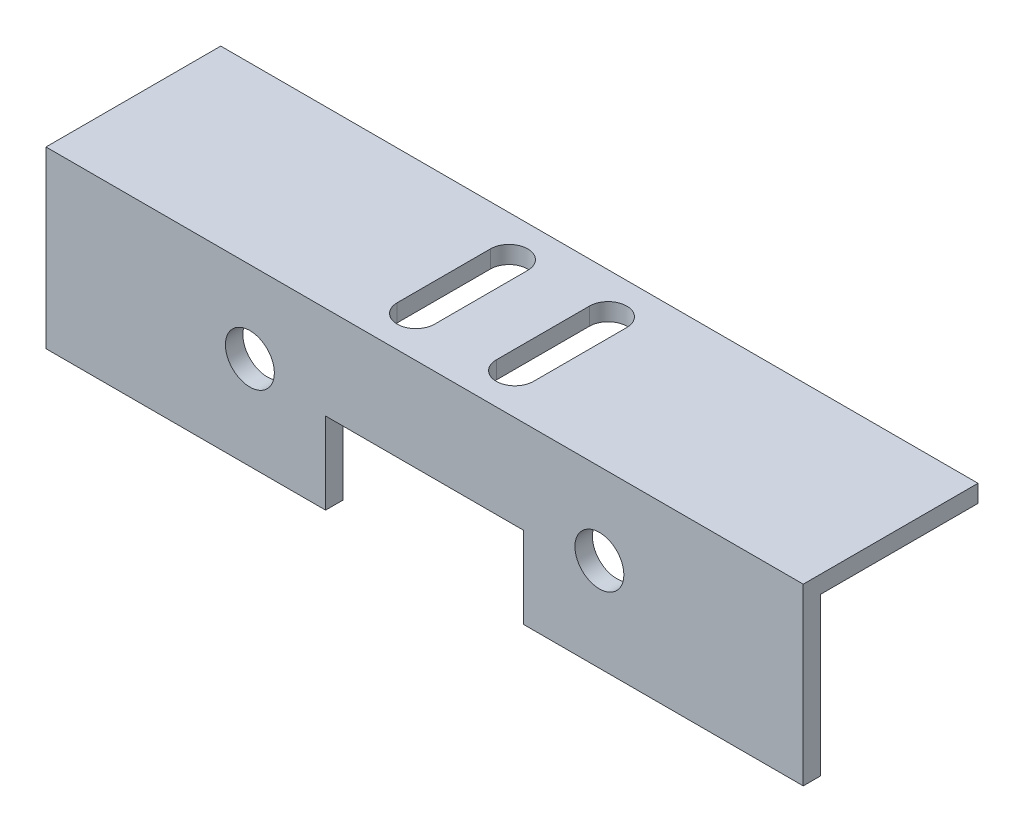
from build123d import *

# Parameters (mm, degrees)
EXTRUDE_1_DEPTH     = 65
SKETCH_2_R          = 2.1
SKETCH_2_W          = 17
SKETCH_2_H          = 17.969035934
CUT_EXTRUDE_1_DEPTH = 69.373971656
CUT_EXTRUDE_2_DEPTH = 69.373971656


with BuildPart() as part:
    # Sketch 1 → Extrude 1 (new body)
    with BuildSketch(Plane(origin=(0, 0, 0), x_dir=(0, 0, -1), z_dir=(1, 0, 0))):
        Polygon((0, 0), (0, 15), (15, 15), (15, 13.5), (1.5, 13.5), (1.5, 0), align=None)
    extrude(amount=EXTRUDE_1_DEPTH)

    # Sketch 2 → Cut-Extrude 1 (cut, through all)
    with BuildSketch(Plane.XY):
        with Locations((17.5, 8)):
            Circle(SKETCH_2_R)
        with Locations((47.5, 8)):
            Circle(SKETCH_2_R)
        with Locations((32.5, -1.984517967)):
            Rectangle(SKETCH_2_W, SKETCH_2_H)
    extrude(amount=-CUT_EXTRUDE_1_DEPTH, mode=Mode.SUBTRACT)

    # Sketch 3 → Cut-Extrude 2 (cut, through all)
    with BuildSketch(Plane(origin=(0, 15, 0), x_dir=(1, 0, 0), z_dir=(0, 1, 0))):
        with BuildLine():
            Line((26.65, 3.5), (26.65, 11.5))
            ThreePointArc((26.65, 11.5), (28.25, 13.1), (29.85, 11.5))
            Line((29.85, 11.5), (29.85, 3.5))
            ThreePointArc((29.85, 3.5), (28.25, 1.9), (26.65, 3.5))
        make_face()
        with BuildLine():
            Line((35.15, 3.5), (35.15, 11.5))
            ThreePointArc((35.15, 11.5), (36.75, 13.1), (38.35, 11.5))
            Line((38.35, 11.5), (38.35, 3.5))
            ThreePointArc((38.35, 3.5), (36.75, 1.9), (35.15, 3.5))
        make_face()
    extrude(amount=-CUT_EXTRUDE_2_DEPTH, mode=Mode.SUBTRACT)


solid = part.part
